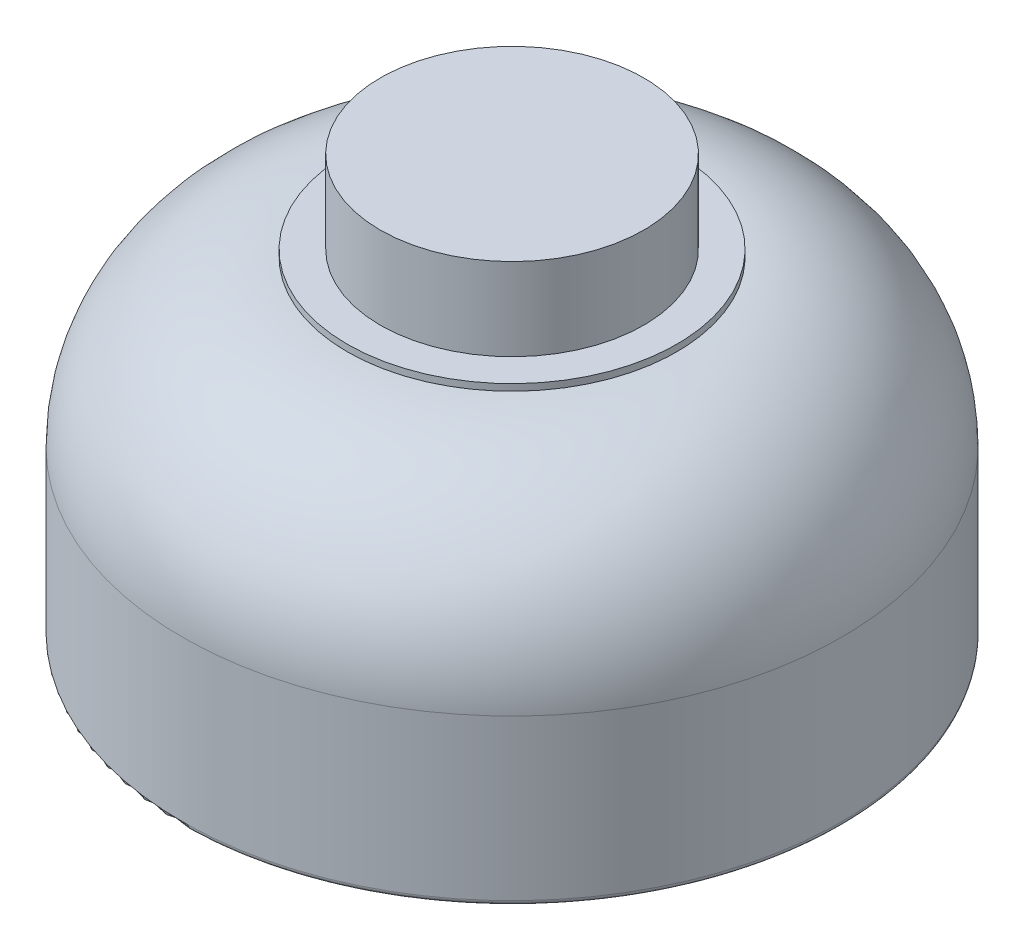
ISO-10303-21;
HEADER;
FILE_DESCRIPTION(('STEP AP214'),'2;1');
FILE_NAME('part.step','',(''),(''),'','','');
FILE_SCHEMA(('AUTOMOTIVE_DESIGN { 1 0 10303 214 1 1 1 1 }'));
ENDSEC;
DATA;
#1=APPLICATION_CONTEXT('core data for automotive mechanical design processes');
#2=APPLICATION_PROTOCOL_DEFINITION('international standard','automotive_design',2000,#1);
#3=PRODUCT_CONTEXT('',#1,'mechanical');
#4=PRODUCT('Part','Part','',(#3));
#5=PRODUCT_RELATED_PRODUCT_CATEGORY('part','',(#4));
#6=PRODUCT_DEFINITION_FORMATION('','',#4);
#7=PRODUCT_DEFINITION_CONTEXT('part definition',#1,'design');
#8=PRODUCT_DEFINITION('design','',#6,#7);
#9=PRODUCT_DEFINITION_SHAPE('','',#8);
#10=(LENGTH_UNIT() NAMED_UNIT(*) SI_UNIT(.MILLI.,.METRE.));
#11=(NAMED_UNIT(*) PLANE_ANGLE_UNIT() SI_UNIT($,.RADIAN.));
#12=(NAMED_UNIT(*) SI_UNIT($,.STERADIAN.) SOLID_ANGLE_UNIT());
#13=UNCERTAINTY_MEASURE_WITH_UNIT(LENGTH_MEASURE(1.E-05),#10,'distance_accuracy_value','');
#14=(GEOMETRIC_REPRESENTATION_CONTEXT(3) GLOBAL_UNCERTAINTY_ASSIGNED_CONTEXT((#13)) GLOBAL_UNIT_ASSIGNED_CONTEXT((#10,
#11,#12)) REPRESENTATION_CONTEXT('',''));
#15=CARTESIAN_POINT('',(0.,0.,0.));
#16=DIRECTION('',(0.,0.,1.));
#17=DIRECTION('',(1.,0.,0.));
#18=AXIS2_PLACEMENT_3D('',#15,#16,#17);
#19=CARTESIAN_POINT('',(0.,32.,0.));
#20=DIRECTION('',(0.,-1.,0.));
#21=DIRECTION('',(0.,0.,-1.));
#22=AXIS2_PLACEMENT_3D('',#19,#20,#21);
#23=CYLINDRICAL_SURFACE('',#22,50.);
#24=CARTESIAN_POINT('',(0.,32.,0.));
#25=DIRECTION('',(0.,1.,0.));
#26=DIRECTION('',(0.,0.,1.));
#27=AXIS2_PLACEMENT_3D('',#24,#25,#26);
#28=CIRCLE('',#27,50.);
#29=CARTESIAN_POINT('',(0.,32.,50.));
#30=VERTEX_POINT('',#29);
#31=EDGE_CURVE('E49',#30,#30,#28,.T.);
#32=ORIENTED_EDGE('',*,*,#31,.F.);
#33=EDGE_LOOP('',(#32));
#34=FACE_BOUND('',#33,.T.);
#35=CARTESIAN_POINT('',(0.,30.,0.));
#36=DIRECTION('',(0.,1.,0.));
#37=DIRECTION('',(0.,0.,1.));
#38=AXIS2_PLACEMENT_3D('',#35,#36,#37);
#39=CIRCLE('',#38,50.);
#40=CARTESIAN_POINT('',(0.,30.,50.));
#41=VERTEX_POINT('',#40);
#42=EDGE_CURVE('E45',#41,#41,#39,.T.);
#43=ORIENTED_EDGE('',*,*,#42,.T.);
#44=EDGE_LOOP('',(#43));
#45=FACE_BOUND('',#44,.T.);
#46=ADVANCED_FACE('F42',(#34,#45),#23,.T.);
#47=CARTESIAN_POINT('',(0.,32.,0.));
#48=DIRECTION('',(0.,1.,0.));
#49=DIRECTION('',(0.,0.,1.));
#50=AXIS2_PLACEMENT_3D('',#47,#48,#49);
#51=PLANE('',#50);
#52=CARTESIAN_POINT('',(0.,32.,0.));
#53=DIRECTION('',(0.,1.,0.));
#54=DIRECTION('',(0.,0.,1.));
#55=AXIS2_PLACEMENT_3D('',#52,#53,#54);
#56=CIRCLE('',#55,40.);
#57=CARTESIAN_POINT('',(0.,32.,40.));
#58=VERTEX_POINT('',#57);
#59=EDGE_CURVE('E11',#58,#58,#56,.T.);
#60=ORIENTED_EDGE('',*,*,#59,.F.);
#61=EDGE_LOOP('',(#60));
#62=FACE_BOUND('',#61,.T.);
#63=ORIENTED_EDGE('',*,*,#31,.T.);
#64=EDGE_LOOP('',(#63));
#65=FACE_BOUND('',#64,.T.);
#66=ADVANCED_FACE('F66',(#62,#65),#51,.T.);
#67=CARTESIAN_POINT('',(0.,30.,0.));
#68=DIRECTION('',(0.,1.,0.));
#69=DIRECTION('',(0.,0.,1.));
#70=AXIS2_PLACEMENT_3D('',#67,#68,#69);
#71=PLANE('',#70);
#72=ORIENTED_EDGE('',*,*,#42,.F.);
#73=EDGE_LOOP('',(#72));
#74=FACE_BOUND('',#73,.T.);
#75=ADVANCED_FACE('F63',(#74),#71,.F.);
#76=CARTESIAN_POINT('',(0.,57.,0.));
#77=DIRECTION('',(0.,-1.,0.));
#78=DIRECTION('',(0.,0.,-1.));
#79=AXIS2_PLACEMENT_3D('',#76,#77,#78);
#80=CYLINDRICAL_SURFACE('',#79,40.);
#81=CARTESIAN_POINT('',(0.,57.,0.));
#82=DIRECTION('',(0.,1.,0.));
#83=DIRECTION('',(0.,0.,1.));
#84=AXIS2_PLACEMENT_3D('',#81,#82,#83);
#85=CIRCLE('',#84,40.);
#86=CARTESIAN_POINT('',(0.,57.,40.));
#87=VERTEX_POINT('',#86);
#88=EDGE_CURVE('E55',#87,#87,#85,.T.);
#89=ORIENTED_EDGE('',*,*,#88,.F.);
#90=EDGE_LOOP('',(#89));
#91=FACE_BOUND('',#90,.T.);
#92=ORIENTED_EDGE('',*,*,#59,.T.);
#93=EDGE_LOOP('',(#92));
#94=FACE_BOUND('',#93,.T.);
#95=ADVANCED_FACE('F65',(#91,#94),#80,.T.);
#96=CARTESIAN_POINT('',(0.,57.,0.));
#97=DIRECTION('',(0.,1.,0.));
#98=DIRECTION('',(0.,0.,1.));
#99=AXIS2_PLACEMENT_3D('',#96,#97,#98);
#100=PLANE('',#99);
#101=ORIENTED_EDGE('',*,*,#88,.T.);
#102=EDGE_LOOP('',(#101));
#103=FACE_BOUND('',#102,.T.);
#104=ADVANCED_FACE('F71',(#103),#100,.T.);
#105=CLOSED_SHELL('',(#46,#66,#75,#95,#104));
#106=MANIFOLD_SOLID_BREP('B2',#105);
#107=CARTESIAN_POINT('',(0.,-10.,0.));
#108=DIRECTION('',(0.,1.,0.));
#109=DIRECTION('',(0.,0.,1.));
#110=AXIS2_PLACEMENT_3D('',#107,#108,#109);
#111=CYLINDRICAL_SURFACE('',#110,50.);
#112=CARTESIAN_POINT('',(0.,0.,0.));
#113=DIRECTION('',(0.,-1.,0.));
#114=DIRECTION('',(0.,0.,-1.));
#115=AXIS2_PLACEMENT_3D('',#112,#113,#114);
#116=CIRCLE('',#115,50.);
#117=CARTESIAN_POINT('',(0.,0.,-50.));
#118=VERTEX_POINT('',#117);
#119=EDGE_CURVE('E41',#118,#118,#116,.F.);
#120=ORIENTED_EDGE('',*,*,#119,.T.);
#121=EDGE_LOOP('',(#120));
#122=FACE_BOUND('',#121,.T.);
#123=CARTESIAN_POINT('',(0.,5.,0.));
#124=DIRECTION('',(0.,-1.,0.));
#125=DIRECTION('',(0.,0.,-1.));
#126=AXIS2_PLACEMENT_3D('',#123,#124,#125);
#127=CIRCLE('',#126,50.);
#128=CARTESIAN_POINT('',(0.,5.,-50.));
#129=VERTEX_POINT('',#128);
#130=EDGE_CURVE('E132',#129,#129,#127,.T.);
#131=ORIENTED_EDGE('',*,*,#130,.T.);
#132=EDGE_LOOP('',(#131));
#133=FACE_BOUND('',#132,.T.);
#134=ADVANCED_FACE('F121',(#122,#133),#111,.T.);
#135=CARTESIAN_POINT('',(0.,-10.,0.));
#136=DIRECTION('',(0.,-1.,0.));
#137=DIRECTION('',(0.,0.,-1.));
#138=AXIS2_PLACEMENT_3D('',#135,#136,#137);
#139=PLANE('',#138);
#140=CARTESIAN_POINT('',(0.,-10.,0.));
#141=DIRECTION('',(0.,-1.,0.));
#142=DIRECTION('',(0.,0.,-1.));
#143=AXIS2_PLACEMENT_3D('',#140,#141,#142);
#144=CIRCLE('',#143,40.);
#145=CARTESIAN_POINT('',(0.,-10.,-40.));
#146=VERTEX_POINT('',#145);
#147=EDGE_CURVE('E128',#146,#146,#144,.T.);
#148=ORIENTED_EDGE('',*,*,#147,.T.);
#149=EDGE_LOOP('',(#148));
#150=FACE_BOUND('',#149,.T.);
#151=ADVANCED_FACE('F142',(#150),#139,.T.);
#152=CARTESIAN_POINT('',(0.,5.,0.));
#153=DIRECTION('',(0.,-1.,0.));
#154=DIRECTION('',(0.,0.,-1.));
#155=AXIS2_PLACEMENT_3D('',#152,#153,#154);
#156=PLANE('',#155);
#157=ORIENTED_EDGE('',*,*,#130,.F.);
#158=EDGE_LOOP('',(#157));
#159=FACE_BOUND('',#158,.T.);
#160=ADVANCED_FACE('F140',(#159),#156,.F.);
#161=CARTESIAN_POINT('',(0.,0.,0.));
#162=DIRECTION('',(0.,-1.,0.));
#163=DIRECTION('',(0.,0.,-1.));
#164=AXIS2_PLACEMENT_3D('',#161,#162,#163);
#165=TOROIDAL_SURFACE('',#164,40.,10.);
#166=ORIENTED_EDGE('',*,*,#119,.F.);
#167=EDGE_LOOP('',(#166));
#168=FACE_BOUND('',#167,.T.);
#169=ORIENTED_EDGE('',*,*,#147,.F.);
#170=EDGE_LOOP('',(#169));
#171=FACE_BOUND('',#170,.T.);
#172=ADVANCED_FACE('F123',(#168,#171),#165,.T.);
#173=CLOSED_SHELL('',(#134,#151,#160,#172));
#174=MANIFOLD_SOLID_BREP('B6',#173);
#175=CARTESIAN_POINT('',(0.,5.,0.));
#176=DIRECTION('',(0.,1.,0.));
#177=DIRECTION('',(0.,0.,1.));
#178=AXIS2_PLACEMENT_3D('',#175,#176,#177);
#179=CYLINDRICAL_SURFACE('',#178,50.);
#180=CARTESIAN_POINT('',(0.,5.,0.));
#181=DIRECTION('',(0.,-1.,0.));
#182=DIRECTION('',(0.,0.,-1.));
#183=AXIS2_PLACEMENT_3D('',#180,#181,#182);
#184=CIRCLE('',#183,50.);
#185=CARTESIAN_POINT('',(0.,5.,-50.));
#186=VERTEX_POINT('',#185);
#187=EDGE_CURVE('E120',#186,#186,#184,.T.);
#188=ORIENTED_EDGE('',*,*,#187,.F.);
#189=EDGE_LOOP('',(#188));
#190=FACE_BOUND('',#189,.T.);
#191=CARTESIAN_POINT('',(0.,25.,0.));
#192=DIRECTION('',(0.,-1.,0.));
#193=DIRECTION('',(0.,0.,-1.));
#194=AXIS2_PLACEMENT_3D('',#191,#192,#193);
#195=CIRCLE('',#194,50.);
#196=CARTESIAN_POINT('',(0.,25.,-50.));
#197=VERTEX_POINT('',#196);
#198=EDGE_CURVE('E188',#197,#197,#195,.T.);
#199=ORIENTED_EDGE('',*,*,#198,.T.);
#200=EDGE_LOOP('',(#199));
#201=FACE_BOUND('',#200,.T.);
#202=ADVANCED_FACE('F185',(#190,#201),#179,.T.);
#203=CARTESIAN_POINT('',(0.,5.,0.));
#204=DIRECTION('',(0.,-1.,0.));
#205=DIRECTION('',(0.,0.,-1.));
#206=AXIS2_PLACEMENT_3D('',#203,#204,#205);
#207=PLANE('',#206);
#208=ORIENTED_EDGE('',*,*,#187,.T.);
#209=EDGE_LOOP('',(#208));
#210=FACE_BOUND('',#209,.T.);
#211=ADVANCED_FACE('F200',(#210),#207,.T.);
#212=CARTESIAN_POINT('',(0.,25.,0.));
#213=DIRECTION('',(0.,-1.,0.));
#214=DIRECTION('',(0.,0.,-1.));
#215=AXIS2_PLACEMENT_3D('',#212,#213,#214);
#216=PLANE('',#215);
#217=ORIENTED_EDGE('',*,*,#198,.F.);
#218=EDGE_LOOP('',(#217));
#219=FACE_BOUND('',#218,.T.);
#220=ADVANCED_FACE('F198',(#219),#216,.F.);
#221=CLOSED_SHELL('',(#202,#211,#220));
#222=MANIFOLD_SOLID_BREP('B36',#221);
#223=CARTESIAN_POINT('',(0.,25.,0.));
#224=DIRECTION('',(0.,1.,0.));
#225=DIRECTION('',(0.,0.,1.));
#226=AXIS2_PLACEMENT_3D('',#223,#224,#225);
#227=CYLINDRICAL_SURFACE('',#226,50.);
#228=CARTESIAN_POINT('',(0.,25.,0.));
#229=DIRECTION('',(0.,-1.,0.));
#230=DIRECTION('',(0.,0.,-1.));
#231=AXIS2_PLACEMENT_3D('',#228,#229,#230);
#232=CIRCLE('',#231,50.);
#233=CARTESIAN_POINT('',(0.,25.,-50.));
#234=VERTEX_POINT('',#233);
#235=EDGE_CURVE('E184',#234,#234,#232,.T.);
#236=ORIENTED_EDGE('',*,*,#235,.F.);
#237=EDGE_LOOP('',(#236));
#238=FACE_BOUND('',#237,.T.);
#239=CARTESIAN_POINT('',(0.,27.,0.));
#240=DIRECTION('',(0.,-1.,0.));
#241=DIRECTION('',(0.,0.,-1.));
#242=AXIS2_PLACEMENT_3D('',#239,#240,#241);
#243=CIRCLE('',#242,50.);
#244=CARTESIAN_POINT('',(0.,27.,-50.));
#245=VERTEX_POINT('',#244);
#246=EDGE_CURVE('E236',#245,#245,#243,.T.);
#247=ORIENTED_EDGE('',*,*,#246,.T.);
#248=EDGE_LOOP('',(#247));
#249=FACE_BOUND('',#248,.T.);
#250=ADVANCED_FACE('F233',(#238,#249),#227,.T.);
#251=CARTESIAN_POINT('',(0.,25.,0.));
#252=DIRECTION('',(0.,-1.,0.));
#253=DIRECTION('',(0.,0.,-1.));
#254=AXIS2_PLACEMENT_3D('',#251,#252,#253);
#255=PLANE('',#254);
#256=ORIENTED_EDGE('',*,*,#235,.T.);
#257=EDGE_LOOP('',(#256));
#258=FACE_BOUND('',#257,.T.);
#259=ADVANCED_FACE('F248',(#258),#255,.T.);
#260=CARTESIAN_POINT('',(0.,27.,0.));
#261=DIRECTION('',(0.,-1.,0.));
#262=DIRECTION('',(0.,0.,-1.));
#263=AXIS2_PLACEMENT_3D('',#260,#261,#262);
#264=PLANE('',#263);
#265=ORIENTED_EDGE('',*,*,#246,.F.);
#266=EDGE_LOOP('',(#265));
#267=FACE_BOUND('',#266,.T.);
#268=ADVANCED_FACE('F246',(#267),#264,.F.);
#269=CLOSED_SHELL('',(#250,#259,#268));
#270=MANIFOLD_SOLID_BREP('B115',#269);
#271=CARTESIAN_POINT('',(50.,30.,0.));
#272=DIRECTION('',(0.,-1.,0.));
#273=DIRECTION('',(1.,0.,0.));
#274=AXIS2_PLACEMENT_3D('',#271,#272,#273);
#275=PLANE('',#274);
#276=CARTESIAN_POINT('',(0.,30.,0.));
#277=DIRECTION('',(0.,1.,0.));
#278=DIRECTION('',(-1.,0.,0.));
#279=AXIS2_PLACEMENT_3D('',#276,#277,#278);
#280=CIRCLE('',#279,50.);
#281=CARTESIAN_POINT('',(-50.,30.,0.));
#282=VERTEX_POINT('',#281);
#283=EDGE_CURVE('E286',#282,#282,#280,.T.);
#284=ORIENTED_EDGE('',*,*,#283,.T.);
#285=EDGE_LOOP('',(#284));
#286=FACE_BOUND('',#285,.T.);
#287=ADVANCED_FACE('F274',(#286),#275,.F.);
#288=CARTESIAN_POINT('',(0.,-20.,0.));
#289=DIRECTION('',(0.,1.,0.));
#290=DIRECTION('',(-1.,0.,0.));
#291=AXIS2_PLACEMENT_3D('',#288,#289,#290);
#292=DEGENERATE_TOROIDAL_SURFACE('',#291,50.,50.,.T.);
#293=ORIENTED_EDGE('',*,*,#283,.F.);
#294=EDGE_LOOP('',(#293));
#295=FACE_BOUND('',#294,.T.);
#296=CARTESIAN_POINT('',(0.,-20.,0.));
#297=DIRECTION('',(0.,1.,0.));
#298=DIRECTION('',(-1.,0.,0.));
#299=AXIS2_PLACEMENT_3D('',#296,#297,#298);
#300=CIRCLE('',#299,100.);
#301=CARTESIAN_POINT('',(-100.,-20.,0.));
#302=VERTEX_POINT('',#301);
#303=EDGE_CURVE('E291',#302,#302,#300,.T.);
#304=ORIENTED_EDGE('',*,*,#303,.T.);
#305=EDGE_LOOP('',(#304));
#306=FACE_BOUND('',#305,.T.);
#307=ADVANCED_FACE('F314',(#295,#306),#292,.T.);
#308=CARTESIAN_POINT('',(0.,30.,0.));
#309=DIRECTION('',(0.,1.,0.));
#310=DIRECTION('',(-1.,0.,0.));
#311=AXIS2_PLACEMENT_3D('',#308,#309,#310);
#312=CYLINDRICAL_SURFACE('',#311,100.);
#313=CARTESIAN_POINT('',(0.,-68.5,0.));
#314=DIRECTION('',(0.,1.,0.));
#315=DIRECTION('',(-1.,0.,0.));
#316=AXIS2_PLACEMENT_3D('',#313,#314,#315);
#317=CIRCLE('',#316,100.);
#318=CARTESIAN_POINT('',(-100.,-68.5,0.));
#319=VERTEX_POINT('',#318);
#320=EDGE_CURVE('E282',#319,#319,#317,.T.);
#321=ORIENTED_EDGE('',*,*,#320,.T.);
#322=EDGE_LOOP('',(#321));
#323=FACE_BOUND('',#322,.T.);
#324=ORIENTED_EDGE('',*,*,#303,.F.);
#325=EDGE_LOOP('',(#324));
#326=FACE_BOUND('',#325,.T.);
#327=ADVANCED_FACE('F306',(#323,#326),#312,.T.);
#328=CARTESIAN_POINT('',(50.,27.,0.));
#329=DIRECTION('',(0.,-1.,0.));
#330=DIRECTION('',(1.,0.,0.));
#331=AXIS2_PLACEMENT_3D('',#328,#329,#330);
#332=PLANE('',#331);
#333=CARTESIAN_POINT('',(0.,27.,0.));
#334=DIRECTION('',(0.,1.,0.));
#335=DIRECTION('',(-1.,0.,0.));
#336=AXIS2_PLACEMENT_3D('',#333,#334,#335);
#337=CIRCLE('',#336,50.);
#338=CARTESIAN_POINT('',(-50.,27.,0.));
#339=VERTEX_POINT('',#338);
#340=EDGE_CURVE('E294',#339,#339,#337,.T.);
#341=ORIENTED_EDGE('',*,*,#340,.F.);
#342=EDGE_LOOP('',(#341));
#343=FACE_BOUND('',#342,.T.);
#344=ADVANCED_FACE('F304',(#343),#332,.T.);
#345=CARTESIAN_POINT('',(0.,-20.,0.));
#346=DIRECTION('',(0.,1.,0.));
#347=DIRECTION('',(-1.,0.,0.));
#348=AXIS2_PLACEMENT_3D('',#345,#346,#347);
#349=TOROIDAL_SURFACE('',#348,50.,47.);
#350=ORIENTED_EDGE('',*,*,#340,.T.);
#351=EDGE_LOOP('',(#350));
#352=FACE_BOUND('',#351,.T.);
#353=CARTESIAN_POINT('',(0.,-20.,0.));
#354=DIRECTION('',(0.,1.,0.));
#355=DIRECTION('',(-1.,0.,0.));
#356=AXIS2_PLACEMENT_3D('',#353,#354,#355);
#357=CIRCLE('',#356,97.);
#358=CARTESIAN_POINT('',(-97.,-20.,0.));
#359=VERTEX_POINT('',#358);
#360=EDGE_CURVE('E295',#359,#359,#357,.T.);
#361=ORIENTED_EDGE('',*,*,#360,.F.);
#362=EDGE_LOOP('',(#361));
#363=FACE_BOUND('',#362,.T.);
#364=ADVANCED_FACE('F301',(#352,#363),#349,.F.);
#365=CARTESIAN_POINT('',(0.,30.,0.));
#366=DIRECTION('',(0.,1.,0.));
#367=DIRECTION('',(-1.,0.,0.));
#368=AXIS2_PLACEMENT_3D('',#365,#366,#367);
#369=CYLINDRICAL_SURFACE('',#368,97.);
#370=CARTESIAN_POINT('',(0.,-68.5,0.));
#371=DIRECTION('',(0.,1.,0.));
#372=DIRECTION('',(-1.,0.,0.));
#373=AXIS2_PLACEMENT_3D('',#370,#371,#372);
#374=CIRCLE('',#373,97.);
#375=CARTESIAN_POINT('',(-97.,-68.5,0.));
#376=VERTEX_POINT('',#375);
#377=EDGE_CURVE('E232',#376,#376,#374,.F.);
#378=ORIENTED_EDGE('',*,*,#377,.T.);
#379=EDGE_LOOP('',(#378));
#380=FACE_BOUND('',#379,.T.);
#381=ORIENTED_EDGE('',*,*,#360,.T.);
#382=EDGE_LOOP('',(#381));
#383=FACE_BOUND('',#382,.T.);
#384=ADVANCED_FACE('F312',(#380,#383),#369,.F.);
#385=CARTESIAN_POINT('',(0.,-68.5,0.));
#386=DIRECTION('',(0.,1.,0.));
#387=DIRECTION('',(-1.,0.,0.));
#388=AXIS2_PLACEMENT_3D('',#385,#386,#387);
#389=TOROIDAL_SURFACE('',#388,98.5,1.5);
#390=ORIENTED_EDGE('',*,*,#377,.F.);
#391=EDGE_LOOP('',(#390));
#392=FACE_BOUND('',#391,.T.);
#393=CARTESIAN_POINT('',(0.,-70.,0.));
#394=DIRECTION('',(0.,1.,0.));
#395=DIRECTION('',(-1.,0.,0.));
#396=AXIS2_PLACEMENT_3D('',#393,#394,#395);
#397=CIRCLE('',#396,98.5);
#398=CARTESIAN_POINT('',(-98.5,-70.,0.));
#399=VERTEX_POINT('',#398);
#400=EDGE_CURVE('E278',#399,#399,#397,.T.);
#401=ORIENTED_EDGE('',*,*,#400,.F.);
#402=EDGE_LOOP('',(#401));
#403=FACE_BOUND('',#402,.T.);
#404=ADVANCED_FACE('F276',(#392,#403),#389,.T.);
#405=CARTESIAN_POINT('',(0.,-68.5,0.));
#406=DIRECTION('',(0.,1.,0.));
#407=DIRECTION('',(-1.,0.,0.));
#408=AXIS2_PLACEMENT_3D('',#405,#406,#407);
#409=TOROIDAL_SURFACE('',#408,98.5,1.5);
#410=ORIENTED_EDGE('',*,*,#400,.T.);
#411=EDGE_LOOP('',(#410));
#412=FACE_BOUND('',#411,.T.);
#413=ORIENTED_EDGE('',*,*,#320,.F.);
#414=EDGE_LOOP('',(#413));
#415=FACE_BOUND('',#414,.T.);
#416=ADVANCED_FACE('F325',(#412,#415),#409,.T.);
#417=CLOSED_SHELL('',(#287,#307,#327,#344,#364,#384,#404,#416));
#418=MANIFOLD_SOLID_BREP('B179',#417);
#419=ADVANCED_BREP_SHAPE_REPRESENTATION('',(#18,#106,#174,#222,#270,#418),#14);
#420=SHAPE_DEFINITION_REPRESENTATION(#9,#419);
ENDSEC;
END-ISO-10303-21;
